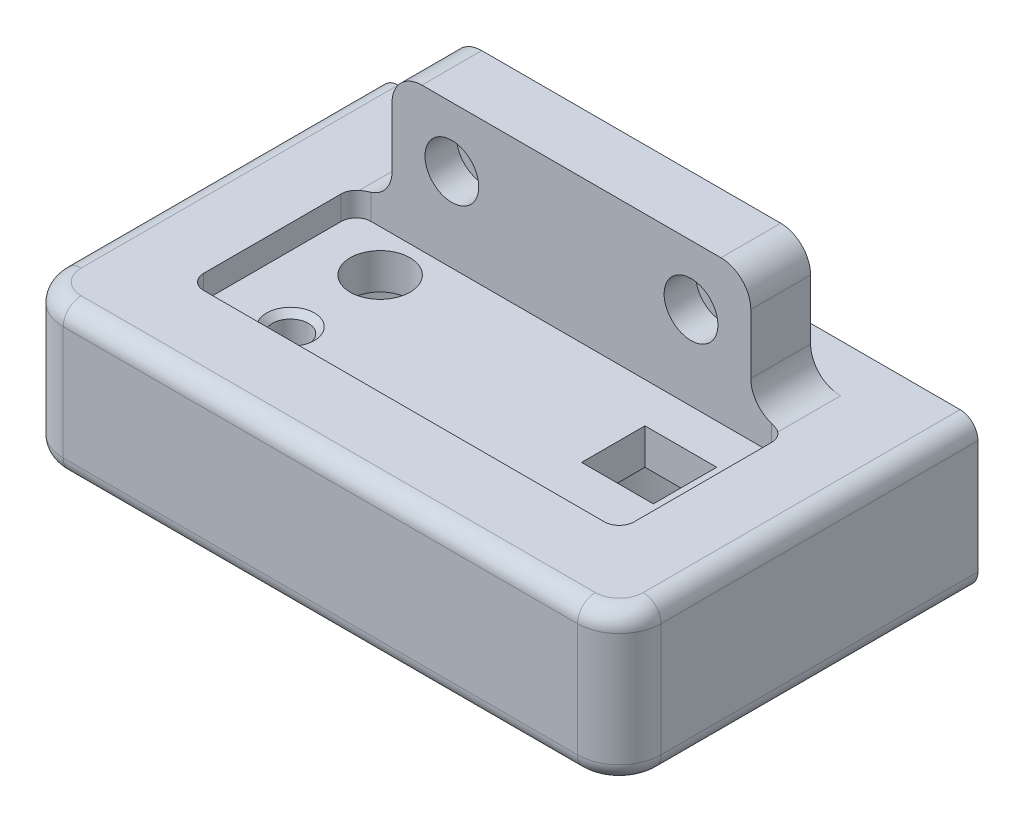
ISO-10303-21;
HEADER;
FILE_DESCRIPTION(('STEP AP214'),'2;1');
FILE_NAME('part.step','',(''),(''),'','','');
FILE_SCHEMA(('AUTOMOTIVE_DESIGN { 1 0 10303 214 1 1 1 1 }'));
ENDSEC;
DATA;
#1=APPLICATION_CONTEXT('core data for automotive mechanical design processes');
#2=APPLICATION_PROTOCOL_DEFINITION('international standard','automotive_design',2000,#1);
#3=PRODUCT_CONTEXT('',#1,'mechanical');
#4=PRODUCT('Part','Part','',(#3));
#5=PRODUCT_RELATED_PRODUCT_CATEGORY('part','',(#4));
#6=PRODUCT_DEFINITION_FORMATION('','',#4);
#7=PRODUCT_DEFINITION_CONTEXT('part definition',#1,'design');
#8=PRODUCT_DEFINITION('design','',#6,#7);
#9=PRODUCT_DEFINITION_SHAPE('','',#8);
#10=(LENGTH_UNIT() NAMED_UNIT(*) SI_UNIT(.MILLI.,.METRE.));
#11=(NAMED_UNIT(*) PLANE_ANGLE_UNIT() SI_UNIT($,.RADIAN.));
#12=(NAMED_UNIT(*) SI_UNIT($,.STERADIAN.) SOLID_ANGLE_UNIT());
#13=UNCERTAINTY_MEASURE_WITH_UNIT(LENGTH_MEASURE(1.E-05),#10,'distance_accuracy_value','');
#14=(GEOMETRIC_REPRESENTATION_CONTEXT(3) GLOBAL_UNCERTAINTY_ASSIGNED_CONTEXT((#13)) GLOBAL_UNIT_ASSIGNED_CONTEXT((#10,
#11,#12)) REPRESENTATION_CONTEXT('',''));
#15=CARTESIAN_POINT('',(0.,0.,0.));
#16=DIRECTION('',(0.,0.,1.));
#17=DIRECTION('',(1.,0.,0.));
#18=AXIS2_PLACEMENT_3D('',#15,#16,#17);
#19=CARTESIAN_POINT('',(25.,25.,25.));
#20=DIRECTION('',(0.,-1.,0.));
#21=DIRECTION('',(0.,0.,-1.));
#22=AXIS2_PLACEMENT_3D('',#19,#20,#21);
#23=CYLINDRICAL_SURFACE('',#22,5.);
#24=CARTESIAN_POINT('',(25.,15.,25.));
#25=DIRECTION('',(0.,-1.,0.));
#26=DIRECTION('',(0.,0.,1.));
#27=AXIS2_PLACEMENT_3D('',#24,#25,#26);
#28=CIRCLE('',#27,5.);
#29=CARTESIAN_POINT('',(25.,15.,30.));
#30=VERTEX_POINT('',#29);
#31=EDGE_CURVE('E325',#30,#30,#28,.T.);
#32=ORIENTED_EDGE('',*,*,#31,.T.);
#33=EDGE_LOOP('',(#32));
#34=FACE_BOUND('',#33,.T.);
#35=CARTESIAN_POINT('',(25.,21.,25.));
#36=DIRECTION('',(0.,1.,0.));
#37=DIRECTION('',(0.,0.,1.));
#38=AXIS2_PLACEMENT_3D('',#35,#36,#37);
#39=CIRCLE('',#38,5.);
#40=CARTESIAN_POINT('',(25.,21.,30.));
#41=VERTEX_POINT('',#40);
#42=EDGE_CURVE('E322',#41,#41,#39,.F.);
#43=ORIENTED_EDGE('',*,*,#42,.F.);
#44=EDGE_LOOP('',(#43));
#45=FACE_BOUND('',#44,.T.);
#46=ADVANCED_FACE('F37',(#34,#45),#23,.F.);
#47=CARTESIAN_POINT('',(25.,25.,40.));
#48=DIRECTION('',(0.,-1.,0.));
#49=DIRECTION('',(0.,0.,-1.));
#50=AXIS2_PLACEMENT_3D('',#47,#48,#49);
#51=CYLINDRICAL_SURFACE('',#50,3.00000000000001);
#52=CARTESIAN_POINT('',(25.,20.,40.));
#53=DIRECTION('',(0.,1.,0.));
#54=DIRECTION('',(0.,0.,1.));
#55=AXIS2_PLACEMENT_3D('',#52,#53,#54);
#56=CIRCLE('',#55,3.00000000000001);
#57=CARTESIAN_POINT('',(25.,20.,43.));
#58=VERTEX_POINT('',#57);
#59=EDGE_CURVE('E509',#58,#58,#56,.T.);
#60=ORIENTED_EDGE('',*,*,#59,.T.);
#61=EDGE_LOOP('',(#60));
#62=FACE_BOUND('',#61,.T.);
#63=CARTESIAN_POINT('',(25.,15.,40.));
#64=DIRECTION('',(0.,-1.,0.));
#65=DIRECTION('',(0.,0.,1.));
#66=AXIS2_PLACEMENT_3D('',#63,#64,#65);
#67=CIRCLE('',#66,3.00000000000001);
#68=CARTESIAN_POINT('',(25.,15.,43.));
#69=VERTEX_POINT('',#68);
#70=EDGE_CURVE('E330',#69,#69,#67,.T.);
#71=ORIENTED_EDGE('',*,*,#70,.T.);
#72=EDGE_LOOP('',(#71));
#73=FACE_BOUND('',#72,.T.);
#74=ADVANCED_FACE('F577',(#62,#73),#51,.F.);
#75=CARTESIAN_POINT('',(81.,25.,24.7));
#76=DIRECTION('',(1.,0.,0.));
#77=DIRECTION('',(0.,0.,-1.));
#78=AXIS2_PLACEMENT_3D('',#75,#76,#77);
#79=PLANE('',#78);
#80=DIRECTION('',(0.,0.,1.));
#81=VECTOR('',#80,1.);
#82=CARTESIAN_POINT('',(81.,21.,24.7));
#83=LINE('',#82,#81);
#84=CARTESIAN_POINT('',(81.,21.,24.7));
#85=VERTEX_POINT('',#84);
#86=CARTESIAN_POINT('',(81.,21.,35.3));
#87=VERTEX_POINT('',#86);
#88=EDGE_CURVE('E320',#85,#87,#83,.T.);
#89=ORIENTED_EDGE('',*,*,#88,.F.);
#90=DIRECTION('',(0.,-1.,0.));
#91=VECTOR('',#90,1.);
#92=CARTESIAN_POINT('',(81.,25.,24.7));
#93=LINE('',#92,#91);
#94=CARTESIAN_POINT('',(81.,15.,24.7));
#95=VERTEX_POINT('',#94);
#96=EDGE_CURVE('E340',#85,#95,#93,.T.);
#97=ORIENTED_EDGE('',*,*,#96,.T.);
#98=DIRECTION('',(0.,0.,1.));
#99=VECTOR('',#98,1.);
#100=CARTESIAN_POINT('',(81.,15.,24.7));
#101=LINE('',#100,#99);
#102=CARTESIAN_POINT('',(81.,15.,35.3));
#103=VERTEX_POINT('',#102);
#104=EDGE_CURVE('E326',#95,#103,#101,.T.);
#105=ORIENTED_EDGE('',*,*,#104,.T.);
#106=DIRECTION('',(0.,-1.,0.));
#107=VECTOR('',#106,1.);
#108=CARTESIAN_POINT('',(81.,25.,35.3));
#109=LINE('',#108,#107);
#110=EDGE_CURVE('E339',#87,#103,#109,.T.);
#111=ORIENTED_EDGE('',*,*,#110,.F.);
#112=EDGE_LOOP('',(#89,#97,#105,#111));
#113=FACE_BOUND('',#112,.T.);
#114=ADVANCED_FACE('F583',(#113),#79,.F.);
#115=CARTESIAN_POINT('',(69.,25.,24.7));
#116=DIRECTION('',(0.,0.,-1.));
#117=DIRECTION('',(-1.,0.,0.));
#118=AXIS2_PLACEMENT_3D('',#115,#116,#117);
#119=PLANE('',#118);
#120=DIRECTION('',(1.,0.,0.));
#121=VECTOR('',#120,1.);
#122=CARTESIAN_POINT('',(69.,21.,24.7));
#123=LINE('',#122,#121);
#124=CARTESIAN_POINT('',(69.,21.,24.7));
#125=VERTEX_POINT('',#124);
#126=EDGE_CURVE('E318',#125,#85,#123,.T.);
#127=ORIENTED_EDGE('',*,*,#126,.F.);
#128=DIRECTION('',(0.,-1.,0.));
#129=VECTOR('',#128,1.);
#130=CARTESIAN_POINT('',(69.,25.,24.7));
#131=LINE('',#130,#129);
#132=CARTESIAN_POINT('',(69.,15.,24.7));
#133=VERTEX_POINT('',#132);
#134=EDGE_CURVE('E343',#125,#133,#131,.T.);
#135=ORIENTED_EDGE('',*,*,#134,.T.);
#136=DIRECTION('',(1.,0.,0.));
#137=VECTOR('',#136,1.);
#138=CARTESIAN_POINT('',(69.,15.,24.7));
#139=LINE('',#138,#137);
#140=EDGE_CURVE('E336',#133,#95,#139,.T.);
#141=ORIENTED_EDGE('',*,*,#140,.T.);
#142=ORIENTED_EDGE('',*,*,#96,.F.);
#143=EDGE_LOOP('',(#127,#135,#141,#142));
#144=FACE_BOUND('',#143,.T.);
#145=ADVANCED_FACE('F789',(#144),#119,.F.);
#146=CARTESIAN_POINT('',(69.,25.,24.7));
#147=DIRECTION('',(-1.,0.,0.));
#148=DIRECTION('',(0.,0.,1.));
#149=AXIS2_PLACEMENT_3D('',#146,#147,#148);
#150=PLANE('',#149);
#151=DIRECTION('',(0.,0.,-1.));
#152=VECTOR('',#151,1.);
#153=CARTESIAN_POINT('',(69.,21.,24.7));
#154=LINE('',#153,#152);
#155=CARTESIAN_POINT('',(69.,21.,35.3));
#156=VERTEX_POINT('',#155);
#157=EDGE_CURVE('E306',#156,#125,#154,.T.);
#158=ORIENTED_EDGE('',*,*,#157,.F.);
#159=DIRECTION('',(0.,-1.,0.));
#160=VECTOR('',#159,1.);
#161=CARTESIAN_POINT('',(69.,25.,35.3));
#162=LINE('',#161,#160);
#163=CARTESIAN_POINT('',(69.,15.,35.3));
#164=VERTEX_POINT('',#163);
#165=EDGE_CURVE('E345',#156,#164,#162,.T.);
#166=ORIENTED_EDGE('',*,*,#165,.T.);
#167=DIRECTION('',(0.,0.,-1.));
#168=VECTOR('',#167,1.);
#169=CARTESIAN_POINT('',(69.,15.,24.7));
#170=LINE('',#169,#168);
#171=EDGE_CURVE('E333',#164,#133,#170,.T.);
#172=ORIENTED_EDGE('',*,*,#171,.T.);
#173=ORIENTED_EDGE('',*,*,#134,.F.);
#174=EDGE_LOOP('',(#158,#166,#172,#173));
#175=FACE_BOUND('',#174,.T.);
#176=ADVANCED_FACE('F792',(#175),#150,.F.);
#177=CARTESIAN_POINT('',(69.,25.,35.3));
#178=DIRECTION('',(0.,0.,1.));
#179=DIRECTION('',(1.,0.,0.));
#180=AXIS2_PLACEMENT_3D('',#177,#178,#179);
#181=PLANE('',#180);
#182=DIRECTION('',(-1.,0.,0.));
#183=VECTOR('',#182,1.);
#184=CARTESIAN_POINT('',(69.,21.,35.3));
#185=LINE('',#184,#183);
#186=EDGE_CURVE('E479',#87,#156,#185,.T.);
#187=ORIENTED_EDGE('',*,*,#186,.F.);
#188=ORIENTED_EDGE('',*,*,#110,.T.);
#189=DIRECTION('',(-1.,0.,0.));
#190=VECTOR('',#189,1.);
#191=CARTESIAN_POINT('',(69.,15.,35.3));
#192=LINE('',#191,#190);
#193=EDGE_CURVE('E329',#103,#164,#192,.T.);
#194=ORIENTED_EDGE('',*,*,#193,.T.);
#195=ORIENTED_EDGE('',*,*,#165,.F.);
#196=EDGE_LOOP('',(#187,#188,#194,#195));
#197=FACE_BOUND('',#196,.T.);
#198=ADVANCED_FACE('F640',(#197),#181,.F.);
#199=CARTESIAN_POINT('',(30.,35.,18.));
#200=DIRECTION('',(0.,0.,-1.));
#201=DIRECTION('',(-1.,0.,0.));
#202=AXIS2_PLACEMENT_3D('',#199,#200,#201);
#203=CYLINDRICAL_SURFACE('',#202,3.);
#204=CARTESIAN_POINT('',(30.,35.,8.));
#205=DIRECTION('',(0.,0.,-1.));
#206=DIRECTION('',(-1.,0.,0.));
#207=AXIS2_PLACEMENT_3D('',#204,#205,#206);
#208=CIRCLE('',#207,3.);
#209=CARTESIAN_POINT('',(27.,35.,8.));
#210=VERTEX_POINT('',#209);
#211=EDGE_CURVE('E381',#210,#210,#208,.T.);
#212=ORIENTED_EDGE('',*,*,#211,.T.);
#213=EDGE_LOOP('',(#212));
#214=FACE_BOUND('',#213,.T.);
#215=CARTESIAN_POINT('',(30.,35.,12.7));
#216=DIRECTION('',(0.,0.,1.));
#217=DIRECTION('',(1.,0.,0.));
#218=AXIS2_PLACEMENT_3D('',#215,#216,#217);
#219=CIRCLE('',#218,3.);
#220=CARTESIAN_POINT('',(33.,35.,12.7));
#221=VERTEX_POINT('',#220);
#222=EDGE_CURVE('E377',#221,#221,#219,.F.);
#223=ORIENTED_EDGE('',*,*,#222,.F.);
#224=EDGE_LOOP('',(#223));
#225=FACE_BOUND('',#224,.T.);
#226=ADVANCED_FACE('F636',(#214,#225),#203,.F.);
#227=CARTESIAN_POINT('',(70.,35.,18.));
#228=DIRECTION('',(0.,0.,-1.));
#229=DIRECTION('',(-1.,0.,0.));
#230=AXIS2_PLACEMENT_3D('',#227,#228,#229);
#231=CYLINDRICAL_SURFACE('',#230,3.00000000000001);
#232=CARTESIAN_POINT('',(70.,35.,8.));
#233=DIRECTION('',(0.,0.,-1.));
#234=DIRECTION('',(-1.,0.,0.));
#235=AXIS2_PLACEMENT_3D('',#232,#233,#234);
#236=CIRCLE('',#235,3.00000000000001);
#237=CARTESIAN_POINT('',(67.,35.,8.));
#238=VERTEX_POINT('',#237);
#239=EDGE_CURVE('E386',#238,#238,#236,.T.);
#240=ORIENTED_EDGE('',*,*,#239,.T.);
#241=EDGE_LOOP('',(#240));
#242=FACE_BOUND('',#241,.T.);
#243=CARTESIAN_POINT('',(70.,35.,12.7));
#244=DIRECTION('',(0.,0.,1.));
#245=DIRECTION('',(1.,0.,0.));
#246=AXIS2_PLACEMENT_3D('',#243,#244,#245);
#247=CIRCLE('',#246,3.00000000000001);
#248=CARTESIAN_POINT('',(73.,35.,12.7));
#249=VERTEX_POINT('',#248);
#250=EDGE_CURVE('E355',#249,#249,#247,.F.);
#251=ORIENTED_EDGE('',*,*,#250,.F.);
#252=EDGE_LOOP('',(#251));
#253=FACE_BOUND('',#252,.T.);
#254=ADVANCED_FACE('F632',(#242,#253),#231,.F.);
#255=CARTESIAN_POINT('',(100.,0.,60.));
#256=DIRECTION('',(-1.,0.,0.));
#257=DIRECTION('',(0.,0.,1.));
#258=AXIS2_PLACEMENT_3D('',#255,#256,#257);
#259=PLANE('',#258);
#260=DIRECTION('',(0.,1.,0.));
#261=VECTOR('',#260,1.);
#262=CARTESIAN_POINT('',(100.,0.,0.));
#263=LINE('',#262,#261);
#264=CARTESIAN_POINT('',(100.,3.,0.));
#265=VERTEX_POINT('',#264);
#266=CARTESIAN_POINT('',(100.,22.,0.));
#267=VERTEX_POINT('',#266);
#268=EDGE_CURVE('E417',#265,#267,#263,.T.);
#269=ORIENTED_EDGE('',*,*,#268,.T.);
#270=DIRECTION('',(0.,0.,-1.));
#271=VECTOR('',#270,1.);
#272=CARTESIAN_POINT('',(100.,22.,60.));
#273=LINE('',#272,#271);
#274=CARTESIAN_POINT('',(100.,22.,53.));
#275=VERTEX_POINT('',#274);
#276=EDGE_CURVE('E450',#267,#275,#273,.F.);
#277=ORIENTED_EDGE('',*,*,#276,.T.);
#278=DIRECTION('',(0.,-1.,0.));
#279=VECTOR('',#278,1.);
#280=CARTESIAN_POINT('',(100.,45.,53.));
#281=LINE('',#280,#279);
#282=CARTESIAN_POINT('',(100.,3.00000000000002,53.));
#283=VERTEX_POINT('',#282);
#284=EDGE_CURVE('E382',#275,#283,#281,.T.);
#285=ORIENTED_EDGE('',*,*,#284,.T.);
#286=DIRECTION('',(0.,0.,-1.));
#287=VECTOR('',#286,1.);
#288=CARTESIAN_POINT('',(100.,3.,60.));
#289=LINE('',#288,#287);
#290=EDGE_CURVE('E448',#283,#265,#289,.T.);
#291=ORIENTED_EDGE('',*,*,#290,.T.);
#292=EDGE_LOOP('',(#269,#277,#285,#291));
#293=FACE_BOUND('',#292,.T.);
#294=ADVANCED_FACE('F635',(#293),#259,.F.);
#295=CARTESIAN_POINT('',(0.,0.,60.));
#296=DIRECTION('',(0.,0.,-1.));
#297=DIRECTION('',(-1.,0.,0.));
#298=AXIS2_PLACEMENT_3D('',#295,#296,#297);
#299=PLANE('',#298);
#300=DIRECTION('',(0.,-1.,0.));
#301=VECTOR('',#300,1.);
#302=CARTESIAN_POINT('',(93.,45.,60.));
#303=LINE('',#302,#301);
#304=CARTESIAN_POINT('',(93.,3.00000000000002,60.));
#305=VERTEX_POINT('',#304);
#306=CARTESIAN_POINT('',(93.,22.,60.));
#307=VERTEX_POINT('',#306);
#308=EDGE_CURVE('E423',#305,#307,#303,.F.);
#309=ORIENTED_EDGE('',*,*,#308,.T.);
#310=DIRECTION('',(-1.,0.,0.));
#311=VECTOR('',#310,1.);
#312=CARTESIAN_POINT('',(0.,22.,60.));
#313=LINE('',#312,#311);
#314=CARTESIAN_POINT('',(7.,22.,60.));
#315=VERTEX_POINT('',#314);
#316=EDGE_CURVE('E458',#307,#315,#313,.T.);
#317=ORIENTED_EDGE('',*,*,#316,.T.);
#318=DIRECTION('',(0.,-1.,0.));
#319=VECTOR('',#318,1.);
#320=CARTESIAN_POINT('',(7.,45.,60.));
#321=LINE('',#320,#319);
#322=CARTESIAN_POINT('',(7.,3.00000000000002,60.));
#323=VERTEX_POINT('',#322);
#324=EDGE_CURVE('E426',#323,#315,#321,.F.);
#325=ORIENTED_EDGE('',*,*,#324,.F.);
#326=DIRECTION('',(1.,0.,0.));
#327=VECTOR('',#326,1.);
#328=CARTESIAN_POINT('',(0.,3.,60.));
#329=LINE('',#328,#327);
#330=EDGE_CURVE('E456',#323,#305,#329,.T.);
#331=ORIENTED_EDGE('',*,*,#330,.T.);
#332=EDGE_LOOP('',(#309,#317,#325,#331));
#333=FACE_BOUND('',#332,.T.);
#334=ADVANCED_FACE('F662',(#333),#299,.F.);
#335=CARTESIAN_POINT('',(0.,25.,60.));
#336=DIRECTION('',(0.,-1.,0.));
#337=DIRECTION('',(0.,0.,-1.));
#338=AXIS2_PLACEMENT_3D('',#335,#336,#337);
#339=PLANE('',#338);
#340=CARTESIAN_POINT('',(93.,25.,53.));
#341=DIRECTION('',(0.,-1.,0.));
#342=DIRECTION('',(0.,0.,-1.));
#343=AXIS2_PLACEMENT_3D('',#340,#341,#342);
#344=CIRCLE('',#343,4.00000000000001);
#345=CARTESIAN_POINT('',(93.,25.,57.));
#346=VERTEX_POINT('',#345);
#347=CARTESIAN_POINT('',(97.,25.,53.));
#348=VERTEX_POINT('',#347);
#349=EDGE_CURVE('E435',#346,#348,#344,.F.);
#350=ORIENTED_EDGE('',*,*,#349,.T.);
#351=DIRECTION('',(0.,0.,-1.));
#352=VECTOR('',#351,1.);
#353=CARTESIAN_POINT('',(97.,25.,60.));
#354=LINE('',#353,#352);
#355=CARTESIAN_POINT('',(97.,25.,0.));
#356=VERTEX_POINT('',#355);
#357=EDGE_CURVE('E437',#348,#356,#354,.T.);
#358=ORIENTED_EDGE('',*,*,#357,.T.);
#359=DIRECTION('',(-1.,0.,0.));
#360=VECTOR('',#359,1.);
#361=CARTESIAN_POINT('',(0.,25.,0.));
#362=LINE('',#361,#360);
#363=CARTESIAN_POINT('',(3.,25.,0.));
#364=VERTEX_POINT('',#363);
#365=EDGE_CURVE('E420',#356,#364,#362,.T.);
#366=ORIENTED_EDGE('',*,*,#365,.T.);
#367=DIRECTION('',(0.,0.,-1.));
#368=VECTOR('',#367,1.);
#369=CARTESIAN_POINT('',(3.,25.,60.));
#370=LINE('',#369,#368);
#371=CARTESIAN_POINT('',(3.,25.,53.));
#372=VERTEX_POINT('',#371);
#373=EDGE_CURVE('E429',#364,#372,#370,.F.);
#374=ORIENTED_EDGE('',*,*,#373,.T.);
#375=CARTESIAN_POINT('',(7.,25.,53.));
#376=DIRECTION('',(0.,-1.,0.));
#377=DIRECTION('',(0.,0.,-1.));
#378=AXIS2_PLACEMENT_3D('',#375,#376,#377);
#379=CIRCLE('',#378,4.);
#380=CARTESIAN_POINT('',(7.,25.,57.));
#381=VERTEX_POINT('',#380);
#382=EDGE_CURVE('E431',#372,#381,#379,.F.);
#383=ORIENTED_EDGE('',*,*,#382,.T.);
#384=DIRECTION('',(-1.,0.,0.));
#385=VECTOR('',#384,1.);
#386=CARTESIAN_POINT('',(0.,25.,57.));
#387=LINE('',#386,#385);
#388=EDGE_CURVE('E433',#381,#346,#387,.F.);
#389=ORIENTED_EDGE('',*,*,#388,.T.);
#390=EDGE_LOOP('',(#350,#358,#366,#374,#383,#389));
#391=FACE_BOUND('',#390,.T.);
#392=CARTESIAN_POINT('',(16.5,25.,20.5));
#393=DIRECTION('',(0.,1.,0.));
#394=DIRECTION('',(0.,0.,-1.));
#395=AXIS2_PLACEMENT_3D('',#392,#393,#394);
#396=CIRCLE('',#395,2.5);
#397=CARTESIAN_POINT('',(15.,25.,18.5));
#398=VERTEX_POINT('',#397);
#399=CARTESIAN_POINT('',(14.,25.,20.5));
#400=VERTEX_POINT('',#399);
#401=EDGE_CURVE('E297',#398,#400,#396,.T.);
#402=ORIENTED_EDGE('',*,*,#401,.F.);
#403=DIRECTION('',(0.,0.,1.));
#404=VECTOR('',#403,1.);
#405=CARTESIAN_POINT('',(15.,25.,8.));
#406=LINE('',#405,#404);
#407=CARTESIAN_POINT('',(15.,25.,8.));
#408=VERTEX_POINT('',#407);
#409=EDGE_CURVE('E519',#398,#408,#406,.F.);
#410=ORIENTED_EDGE('',*,*,#409,.T.);
#411=DIRECTION('',(-1.,0.,0.));
#412=VECTOR('',#411,1.);
#413=CARTESIAN_POINT('',(20.,25.,8.));
#414=LINE('',#413,#412);
#415=CARTESIAN_POINT('',(85.,25.,8.));
#416=VERTEX_POINT('',#415);
#417=EDGE_CURVE('E389',#416,#408,#414,.T.);
#418=ORIENTED_EDGE('',*,*,#417,.F.);
#419=DIRECTION('',(0.,0.,-1.));
#420=VECTOR('',#419,1.);
#421=CARTESIAN_POINT('',(85.,25.,18.));
#422=LINE('',#421,#420);
#423=CARTESIAN_POINT('',(85.,25.,18.5));
#424=VERTEX_POINT('',#423);
#425=EDGE_CURVE('E517',#416,#424,#422,.F.);
#426=ORIENTED_EDGE('',*,*,#425,.T.);
#427=CARTESIAN_POINT('',(83.5,25.,20.5));
#428=DIRECTION('',(0.,1.,0.));
#429=DIRECTION('',(0.,0.,-1.));
#430=AXIS2_PLACEMENT_3D('',#427,#428,#429);
#431=CIRCLE('',#430,2.5);
#432=CARTESIAN_POINT('',(86.,25.,20.5));
#433=VERTEX_POINT('',#432);
#434=EDGE_CURVE('E294',#433,#424,#431,.T.);
#435=ORIENTED_EDGE('',*,*,#434,.F.);
#436=DIRECTION('',(0.,0.,-1.));
#437=VECTOR('',#436,1.);
#438=CARTESIAN_POINT('',(86.,25.,43.5));
#439=LINE('',#438,#437);
#440=CARTESIAN_POINT('',(86.,25.,43.5));
#441=VERTEX_POINT('',#440);
#442=EDGE_CURVE('E292',#441,#433,#439,.T.);
#443=ORIENTED_EDGE('',*,*,#442,.F.);
#444=CARTESIAN_POINT('',(83.5,25.,43.5));
#445=DIRECTION('',(0.,1.,0.));
#446=DIRECTION('',(0.,0.,1.));
#447=AXIS2_PLACEMENT_3D('',#444,#445,#446);
#448=CIRCLE('',#447,2.5);
#449=CARTESIAN_POINT('',(83.5,25.,46.));
#450=VERTEX_POINT('',#449);
#451=EDGE_CURVE('E253',#450,#441,#448,.T.);
#452=ORIENTED_EDGE('',*,*,#451,.F.);
#453=DIRECTION('',(1.,0.,0.));
#454=VECTOR('',#453,1.);
#455=CARTESIAN_POINT('',(16.5,25.,46.));
#456=LINE('',#455,#454);
#457=CARTESIAN_POINT('',(16.5,25.,46.));
#458=VERTEX_POINT('',#457);
#459=EDGE_CURVE('E272',#458,#450,#456,.T.);
#460=ORIENTED_EDGE('',*,*,#459,.F.);
#461=CARTESIAN_POINT('',(16.5,25.,43.5));
#462=DIRECTION('',(0.,1.,0.));
#463=DIRECTION('',(0.,0.,-1.));
#464=AXIS2_PLACEMENT_3D('',#461,#462,#463);
#465=CIRCLE('',#464,2.5);
#466=CARTESIAN_POINT('',(14.,25.,43.5));
#467=VERTEX_POINT('',#466);
#468=EDGE_CURVE('E275',#467,#458,#465,.T.);
#469=ORIENTED_EDGE('',*,*,#468,.F.);
#470=DIRECTION('',(0.,0.,1.));
#471=VECTOR('',#470,1.);
#472=CARTESIAN_POINT('',(14.,25.,43.5));
#473=LINE('',#472,#471);
#474=EDGE_CURVE('E299',#400,#467,#473,.T.);
#475=ORIENTED_EDGE('',*,*,#474,.F.);
#476=EDGE_LOOP('',(#402,#410,#418,#426,#435,#443,#452,#460,#469,#475));
#477=FACE_BOUND('',#476,.T.);
#478=ADVANCED_FACE('F665',(#391,#477),#339,.F.);
#479=CARTESIAN_POINT('',(0.,0.,60.));
#480=DIRECTION('',(1.,0.,0.));
#481=DIRECTION('',(0.,0.,-1.));
#482=AXIS2_PLACEMENT_3D('',#479,#480,#481);
#483=PLANE('',#482);
#484=DIRECTION('',(0.,-1.,0.));
#485=VECTOR('',#484,1.);
#486=CARTESIAN_POINT('',(0.,45.,53.));
#487=LINE('',#486,#485);
#488=CARTESIAN_POINT('',(0.,22.,53.));
#489=VERTEX_POINT('',#488);
#490=CARTESIAN_POINT('',(0.,3.00000000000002,53.));
#491=VERTEX_POINT('',#490);
#492=EDGE_CURVE('E378',#489,#491,#487,.T.);
#493=ORIENTED_EDGE('',*,*,#492,.F.);
#494=DIRECTION('',(0.,0.,-1.));
#495=VECTOR('',#494,1.);
#496=CARTESIAN_POINT('',(0.,22.,60.));
#497=LINE('',#496,#495);
#498=CARTESIAN_POINT('',(0.,22.,0.));
#499=VERTEX_POINT('',#498);
#500=EDGE_CURVE('E467',#489,#499,#497,.T.);
#501=ORIENTED_EDGE('',*,*,#500,.T.);
#502=DIRECTION('',(0.,-1.,0.));
#503=VECTOR('',#502,1.);
#504=CARTESIAN_POINT('',(0.,0.,0.));
#505=LINE('',#504,#503);
#506=CARTESIAN_POINT('',(0.,3.,0.));
#507=VERTEX_POINT('',#506);
#508=EDGE_CURVE('E411',#499,#507,#505,.T.);
#509=ORIENTED_EDGE('',*,*,#508,.T.);
#510=DIRECTION('',(0.,0.,-1.));
#511=VECTOR('',#510,1.);
#512=CARTESIAN_POINT('',(0.,3.,60.));
#513=LINE('',#512,#511);
#514=EDGE_CURVE('E465',#507,#491,#513,.F.);
#515=ORIENTED_EDGE('',*,*,#514,.T.);
#516=EDGE_LOOP('',(#493,#501,#509,#515));
#517=FACE_BOUND('',#516,.T.);
#518=ADVANCED_FACE('F673',(#517),#483,.F.);
#519=CARTESIAN_POINT('',(0.,0.,60.));
#520=DIRECTION('',(0.,1.,0.));
#521=DIRECTION('',(0.,0.,1.));
#522=AXIS2_PLACEMENT_3D('',#519,#520,#521);
#523=PLANE('',#522);
#524=CARTESIAN_POINT('',(25.,0.,30.));
#525=DIRECTION('',(0.,-1.,0.));
#526=DIRECTION('',(0.,0.,-1.));
#527=AXIS2_PLACEMENT_3D('',#524,#525,#526);
#528=CIRCLE('',#527,20.);
#529=CARTESIAN_POINT('',(25.,0.,9.99999999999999));
#530=VERTEX_POINT('',#529);
#531=EDGE_CURVE('E368',#530,#530,#528,.T.);
#532=ORIENTED_EDGE('',*,*,#531,.F.);
#533=EDGE_LOOP('',(#532));
#534=FACE_BOUND('',#533,.T.);
#535=CARTESIAN_POINT('',(75.,0.,30.));
#536=DIRECTION('',(0.,-1.,0.));
#537=DIRECTION('',(0.,0.,-1.));
#538=AXIS2_PLACEMENT_3D('',#535,#536,#537);
#539=CIRCLE('',#538,20.);
#540=CARTESIAN_POINT('',(75.,0.,9.99999999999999));
#541=VERTEX_POINT('',#540);
#542=EDGE_CURVE('E374',#541,#541,#539,.T.);
#543=ORIENTED_EDGE('',*,*,#542,.F.);
#544=EDGE_LOOP('',(#543));
#545=FACE_BOUND('',#544,.T.);
#546=CARTESIAN_POINT('',(7.,0.,53.));
#547=DIRECTION('',(0.,1.,0.));
#548=DIRECTION('',(0.,0.,1.));
#549=AXIS2_PLACEMENT_3D('',#546,#547,#548);
#550=CIRCLE('',#549,4.);
#551=CARTESIAN_POINT('',(7.,0.,57.));
#552=VERTEX_POINT('',#551);
#553=CARTESIAN_POINT('',(3.,0.,53.));
#554=VERTEX_POINT('',#553);
#555=EDGE_CURVE('E475',#552,#554,#550,.F.);
#556=ORIENTED_EDGE('',*,*,#555,.T.);
#557=DIRECTION('',(0.,0.,-1.));
#558=VECTOR('',#557,1.);
#559=CARTESIAN_POINT('',(3.,0.,60.));
#560=LINE('',#559,#558);
#561=CARTESIAN_POINT('',(3.,0.,0.));
#562=VERTEX_POINT('',#561);
#563=EDGE_CURVE('E477',#554,#562,#560,.T.);
#564=ORIENTED_EDGE('',*,*,#563,.T.);
#565=DIRECTION('',(1.,0.,0.));
#566=VECTOR('',#565,1.);
#567=CARTESIAN_POINT('',(0.,0.,0.));
#568=LINE('',#567,#566);
#569=CARTESIAN_POINT('',(97.,0.,0.));
#570=VERTEX_POINT('',#569);
#571=EDGE_CURVE('E414',#562,#570,#568,.T.);
#572=ORIENTED_EDGE('',*,*,#571,.T.);
#573=DIRECTION('',(0.,0.,-1.));
#574=VECTOR('',#573,1.);
#575=CARTESIAN_POINT('',(97.,0.,60.));
#576=LINE('',#575,#574);
#577=CARTESIAN_POINT('',(97.,0.,53.));
#578=VERTEX_POINT('',#577);
#579=EDGE_CURVE('E469',#570,#578,#576,.F.);
#580=ORIENTED_EDGE('',*,*,#579,.T.);
#581=CARTESIAN_POINT('',(93.,0.,53.));
#582=DIRECTION('',(0.,1.,0.));
#583=DIRECTION('',(0.,0.,1.));
#584=AXIS2_PLACEMENT_3D('',#581,#582,#583);
#585=CIRCLE('',#584,4.00000000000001);
#586=CARTESIAN_POINT('',(93.,0.,57.));
#587=VERTEX_POINT('',#586);
#588=EDGE_CURVE('E471',#578,#587,#585,.F.);
#589=ORIENTED_EDGE('',*,*,#588,.T.);
#590=DIRECTION('',(1.,0.,0.));
#591=VECTOR('',#590,1.);
#592=CARTESIAN_POINT('',(0.,0.,57.));
#593=LINE('',#592,#591);
#594=EDGE_CURVE('E473',#587,#552,#593,.F.);
#595=ORIENTED_EDGE('',*,*,#594,.T.);
#596=EDGE_LOOP('',(#556,#564,#572,#580,#589,#595));
#597=FACE_BOUND('',#596,.T.);
#598=ADVANCED_FACE('F669',(#534,#545,#597),#523,.F.);
#599=CARTESIAN_POINT('',(0.,0.,0.));
#600=DIRECTION('',(0.,0.,-1.));
#601=DIRECTION('',(-1.,0.,0.));
#602=AXIS2_PLACEMENT_3D('',#599,#600,#601);
#603=PLANE('',#602);
#604=ORIENTED_EDGE('',*,*,#365,.F.);
#605=CARTESIAN_POINT('',(97.,22.,0.));
#606=DIRECTION('',(0.,0.,-1.));
#607=DIRECTION('',(-1.,0.,0.));
#608=AXIS2_PLACEMENT_3D('',#605,#606,#607);
#609=CIRCLE('',#608,3.);
#610=EDGE_CURVE('E446',#356,#267,#609,.T.);
#611=ORIENTED_EDGE('',*,*,#610,.T.);
#612=ORIENTED_EDGE('',*,*,#268,.F.);
#613=CARTESIAN_POINT('',(97.,3.,0.));
#614=DIRECTION('',(0.,0.,-1.));
#615=DIRECTION('',(-1.,0.,0.));
#616=AXIS2_PLACEMENT_3D('',#613,#614,#615);
#617=CIRCLE('',#616,3.);
#618=EDGE_CURVE('E440',#265,#570,#617,.T.);
#619=ORIENTED_EDGE('',*,*,#618,.T.);
#620=ORIENTED_EDGE('',*,*,#571,.F.);
#621=CARTESIAN_POINT('',(3.,3.,0.));
#622=DIRECTION('',(0.,0.,-1.));
#623=DIRECTION('',(-1.,0.,0.));
#624=AXIS2_PLACEMENT_3D('',#621,#622,#623);
#625=CIRCLE('',#624,3.);
#626=EDGE_CURVE('E442',#562,#507,#625,.T.);
#627=ORIENTED_EDGE('',*,*,#626,.T.);
#628=ORIENTED_EDGE('',*,*,#508,.F.);
#629=CARTESIAN_POINT('',(3.,22.,0.));
#630=DIRECTION('',(0.,0.,-1.));
#631=DIRECTION('',(-1.,0.,0.));
#632=AXIS2_PLACEMENT_3D('',#629,#630,#631);
#633=CIRCLE('',#632,3.);
#634=EDGE_CURVE('E444',#499,#364,#633,.T.);
#635=ORIENTED_EDGE('',*,*,#634,.T.);
#636=EDGE_LOOP('',(#604,#611,#612,#619,#620,#627,#628,#635));
#637=FACE_BOUND('',#636,.T.);
#638=ADVANCED_FACE('F660',(#637),#603,.T.);
#639=CARTESIAN_POINT('',(20.,45.,8.));
#640=DIRECTION('',(1.,0.,0.));
#641=DIRECTION('',(0.,0.,-1.));
#642=AXIS2_PLACEMENT_3D('',#639,#640,#641);
#643=PLANE('',#642);
#644=DIRECTION('',(0.,-1.,0.));
#645=VECTOR('',#644,1.);
#646=CARTESIAN_POINT('',(20.,45.,8.));
#647=LINE('',#646,#645);
#648=CARTESIAN_POINT('',(20.,40.,8.));
#649=VERTEX_POINT('',#648);
#650=CARTESIAN_POINT('',(20.,30.,8.));
#651=VERTEX_POINT('',#650);
#652=EDGE_CURVE('E398',#649,#651,#647,.T.);
#653=ORIENTED_EDGE('',*,*,#652,.T.);
#654=DIRECTION('',(0.,0.,1.));
#655=VECTOR('',#654,1.);
#656=CARTESIAN_POINT('',(20.,30.,18.));
#657=LINE('',#656,#655);
#658=CARTESIAN_POINT('',(20.,30.,18.));
#659=VERTEX_POINT('',#658);
#660=EDGE_CURVE('E514',#651,#659,#657,.T.);
#661=ORIENTED_EDGE('',*,*,#660,.T.);
#662=DIRECTION('',(0.,-1.,0.));
#663=VECTOR('',#662,1.);
#664=CARTESIAN_POINT('',(20.,45.,18.));
#665=LINE('',#664,#663);
#666=CARTESIAN_POINT('',(20.,40.,18.));
#667=VERTEX_POINT('',#666);
#668=EDGE_CURVE('E408',#667,#659,#665,.T.);
#669=ORIENTED_EDGE('',*,*,#668,.F.);
#670=DIRECTION('',(0.,0.,1.));
#671=VECTOR('',#670,1.);
#672=CARTESIAN_POINT('',(20.,40.,8.));
#673=LINE('',#672,#671);
#674=EDGE_CURVE('E512',#667,#649,#673,.F.);
#675=ORIENTED_EDGE('',*,*,#674,.T.);
#676=EDGE_LOOP('',(#653,#661,#669,#675));
#677=FACE_BOUND('',#676,.T.);
#678=ADVANCED_FACE('F656',(#677),#643,.F.);
#679=CARTESIAN_POINT('',(20.,45.,18.));
#680=DIRECTION('',(0.,0.,-1.));
#681=DIRECTION('',(-1.,0.,0.));
#682=AXIS2_PLACEMENT_3D('',#679,#680,#681);
#683=PLANE('',#682);
#684=CARTESIAN_POINT('',(30.,35.,18.));
#685=DIRECTION('',(0.,0.,1.));
#686=DIRECTION('',(1.,0.,0.));
#687=AXIS2_PLACEMENT_3D('',#684,#685,#686);
#688=CIRCLE('',#687,4.5);
#689=CARTESIAN_POINT('',(34.5,35.,18.));
#690=VERTEX_POINT('',#689);
#691=EDGE_CURVE('E356',#690,#690,#688,.T.);
#692=ORIENTED_EDGE('',*,*,#691,.F.);
#693=EDGE_LOOP('',(#692));
#694=FACE_BOUND('',#693,.T.);
#695=CARTESIAN_POINT('',(70.,35.,18.));
#696=DIRECTION('',(0.,0.,1.));
#697=DIRECTION('',(1.,0.,0.));
#698=AXIS2_PLACEMENT_3D('',#695,#696,#697);
#699=CIRCLE('',#698,4.50000000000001);
#700=CARTESIAN_POINT('',(74.5,35.,18.));
#701=VERTEX_POINT('',#700);
#702=EDGE_CURVE('E342',#701,#701,#699,.T.);
#703=ORIENTED_EDGE('',*,*,#702,.F.);
#704=EDGE_LOOP('',(#703));
#705=FACE_BOUND('',#704,.T.);
#706=DIRECTION('',(1.,0.,0.));
#707=VECTOR('',#706,1.);
#708=CARTESIAN_POINT('',(20.,45.,18.));
#709=LINE('',#708,#707);
#710=CARTESIAN_POINT('',(25.,45.,18.));
#711=VERTEX_POINT('',#710);
#712=CARTESIAN_POINT('',(75.,45.,18.));
#713=VERTEX_POINT('',#712);
#714=EDGE_CURVE('E392',#711,#713,#709,.T.);
#715=ORIENTED_EDGE('',*,*,#714,.F.);
#716=CARTESIAN_POINT('',(25.,40.,18.));
#717=DIRECTION('',(0.,0.,-1.));
#718=DIRECTION('',(-1.,0.,0.));
#719=AXIS2_PLACEMENT_3D('',#716,#717,#718);
#720=CIRCLE('',#719,5.);
#721=EDGE_CURVE('E530',#711,#667,#720,.F.);
#722=ORIENTED_EDGE('',*,*,#721,.T.);
#723=ORIENTED_EDGE('',*,*,#668,.T.);
#724=CARTESIAN_POINT('',(15.,30.,18.));
#725=DIRECTION('',(0.,0.,-1.));
#726=DIRECTION('',(-1.,0.,0.));
#727=AXIS2_PLACEMENT_3D('',#724,#725,#726);
#728=CIRCLE('',#727,5.);
#729=CARTESIAN_POINT('',(16.5,25.2303039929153,18.));
#730=VERTEX_POINT('',#729);
#731=EDGE_CURVE('E541',#659,#730,#728,.T.);
#732=ORIENTED_EDGE('',*,*,#731,.T.);
#733=DIRECTION('',(0.,1.,0.));
#734=VECTOR('',#733,1.);
#735=CARTESIAN_POINT('',(16.5,21.,18.));
#736=LINE('',#735,#734);
#737=CARTESIAN_POINT('',(16.5,21.,18.));
#738=VERTEX_POINT('',#737);
#739=EDGE_CURVE('E60',#738,#730,#736,.T.);
#740=ORIENTED_EDGE('',*,*,#739,.F.);
#741=DIRECTION('',(-1.,0.,0.));
#742=VECTOR('',#741,1.);
#743=CARTESIAN_POINT('',(16.5,21.,18.));
#744=LINE('',#743,#742);
#745=CARTESIAN_POINT('',(83.5,21.,18.));
#746=VERTEX_POINT('',#745);
#747=EDGE_CURVE('E279',#746,#738,#744,.T.);
#748=ORIENTED_EDGE('',*,*,#747,.F.);
#749=DIRECTION('',(0.,1.,0.));
#750=VECTOR('',#749,1.);
#751=CARTESIAN_POINT('',(83.5,21.,18.));
#752=LINE('',#751,#750);
#753=CARTESIAN_POINT('',(83.5,25.2303039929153,18.));
#754=VERTEX_POINT('',#753);
#755=EDGE_CURVE('E52',#746,#754,#752,.T.);
#756=ORIENTED_EDGE('',*,*,#755,.T.);
#757=CARTESIAN_POINT('',(85.,30.,18.));
#758=DIRECTION('',(0.,0.,-1.));
#759=DIRECTION('',(-1.,0.,0.));
#760=AXIS2_PLACEMENT_3D('',#757,#758,#759);
#761=CIRCLE('',#760,5.);
#762=CARTESIAN_POINT('',(80.,30.,18.));
#763=VERTEX_POINT('',#762);
#764=EDGE_CURVE('E11',#754,#763,#761,.T.);
#765=ORIENTED_EDGE('',*,*,#764,.T.);
#766=DIRECTION('',(0.,-1.,0.));
#767=VECTOR('',#766,1.);
#768=CARTESIAN_POINT('',(80.,45.,18.));
#769=LINE('',#768,#767);
#770=CARTESIAN_POINT('',(80.,40.,18.));
#771=VERTEX_POINT('',#770);
#772=EDGE_CURVE('E405',#771,#763,#769,.T.);
#773=ORIENTED_EDGE('',*,*,#772,.F.);
#774=CARTESIAN_POINT('',(75.,40.,18.));
#775=DIRECTION('',(0.,0.,-1.));
#776=DIRECTION('',(-1.,0.,0.));
#777=AXIS2_PLACEMENT_3D('',#774,#775,#776);
#778=CIRCLE('',#777,5.);
#779=EDGE_CURVE('E528',#771,#713,#778,.F.);
#780=ORIENTED_EDGE('',*,*,#779,.T.);
#781=EDGE_LOOP('',(#715,#722,#723,#732,#740,#748,#756,#765,#773,#780));
#782=FACE_BOUND('',#781,.T.);
#783=ADVANCED_FACE('F652',(#694,#705,#782),#683,.F.);
#784=CARTESIAN_POINT('',(80.,45.,8.));
#785=DIRECTION('',(-1.,0.,0.));
#786=DIRECTION('',(0.,0.,1.));
#787=AXIS2_PLACEMENT_3D('',#784,#785,#786);
#788=PLANE('',#787);
#789=DIRECTION('',(0.,-1.,0.));
#790=VECTOR('',#789,1.);
#791=CARTESIAN_POINT('',(80.,45.,8.));
#792=LINE('',#791,#790);
#793=CARTESIAN_POINT('',(80.,40.,8.));
#794=VERTEX_POINT('',#793);
#795=CARTESIAN_POINT('',(80.,30.,8.));
#796=VERTEX_POINT('',#795);
#797=EDGE_CURVE('E402',#794,#796,#792,.T.);
#798=ORIENTED_EDGE('',*,*,#797,.F.);
#799=DIRECTION('',(0.,0.,-1.));
#800=VECTOR('',#799,1.);
#801=CARTESIAN_POINT('',(80.,40.,18.));
#802=LINE('',#801,#800);
#803=EDGE_CURVE('E539',#794,#771,#802,.F.);
#804=ORIENTED_EDGE('',*,*,#803,.T.);
#805=ORIENTED_EDGE('',*,*,#772,.T.);
#806=DIRECTION('',(0.,0.,-1.));
#807=VECTOR('',#806,1.);
#808=CARTESIAN_POINT('',(80.,30.,8.));
#809=LINE('',#808,#807);
#810=EDGE_CURVE('E536',#763,#796,#809,.T.);
#811=ORIENTED_EDGE('',*,*,#810,.T.);
#812=EDGE_LOOP('',(#798,#804,#805,#811));
#813=FACE_BOUND('',#812,.T.);
#814=ADVANCED_FACE('F648',(#813),#788,.F.);
#815=CARTESIAN_POINT('',(20.,45.,8.));
#816=DIRECTION('',(0.,0.,1.));
#817=DIRECTION('',(1.,0.,0.));
#818=AXIS2_PLACEMENT_3D('',#815,#816,#817);
#819=PLANE('',#818);
#820=ORIENTED_EDGE('',*,*,#239,.F.);
#821=EDGE_LOOP('',(#820));
#822=FACE_BOUND('',#821,.T.);
#823=ORIENTED_EDGE('',*,*,#211,.F.);
#824=EDGE_LOOP('',(#823));
#825=FACE_BOUND('',#824,.T.);
#826=ORIENTED_EDGE('',*,*,#652,.F.);
#827=CARTESIAN_POINT('',(25.,40.,8.));
#828=DIRECTION('',(0.,0.,1.));
#829=DIRECTION('',(1.,0.,0.));
#830=AXIS2_PLACEMENT_3D('',#827,#828,#829);
#831=CIRCLE('',#830,5.);
#832=CARTESIAN_POINT('',(25.,45.,8.));
#833=VERTEX_POINT('',#832);
#834=EDGE_CURVE('E534',#649,#833,#831,.F.);
#835=ORIENTED_EDGE('',*,*,#834,.T.);
#836=DIRECTION('',(-1.,0.,0.));
#837=VECTOR('',#836,1.);
#838=CARTESIAN_POINT('',(20.,45.,8.));
#839=LINE('',#838,#837);
#840=CARTESIAN_POINT('',(75.,45.,8.));
#841=VERTEX_POINT('',#840);
#842=EDGE_CURVE('E395',#841,#833,#839,.T.);
#843=ORIENTED_EDGE('',*,*,#842,.F.);
#844=CARTESIAN_POINT('',(75.,40.,8.));
#845=DIRECTION('',(0.,0.,1.));
#846=DIRECTION('',(1.,0.,0.));
#847=AXIS2_PLACEMENT_3D('',#844,#845,#846);
#848=CIRCLE('',#847,5.);
#849=EDGE_CURVE('E532',#841,#794,#848,.F.);
#850=ORIENTED_EDGE('',*,*,#849,.T.);
#851=ORIENTED_EDGE('',*,*,#797,.T.);
#852=CARTESIAN_POINT('',(85.,30.,8.));
#853=DIRECTION('',(0.,0.,1.));
#854=DIRECTION('',(1.,0.,0.));
#855=AXIS2_PLACEMENT_3D('',#852,#853,#854);
#856=CIRCLE('',#855,5.);
#857=EDGE_CURVE('E772',#796,#416,#856,.T.);
#858=ORIENTED_EDGE('',*,*,#857,.T.);
#859=ORIENTED_EDGE('',*,*,#417,.T.);
#860=CARTESIAN_POINT('',(15.,30.,8.));
#861=DIRECTION('',(0.,0.,1.));
#862=DIRECTION('',(1.,0.,0.));
#863=AXIS2_PLACEMENT_3D('',#860,#861,#862);
#864=CIRCLE('',#863,5.);
#865=EDGE_CURVE('E551',#408,#651,#864,.T.);
#866=ORIENTED_EDGE('',*,*,#865,.T.);
#867=EDGE_LOOP('',(#826,#835,#843,#850,#851,#858,#859,#866));
#868=FACE_BOUND('',#867,.T.);
#869=ADVANCED_FACE('F644',(#822,#825,#868),#819,.F.);
#870=CARTESIAN_POINT('',(0.,45.,0.));
#871=DIRECTION('',(0.,1.,0.));
#872=DIRECTION('',(0.,0.,1.));
#873=AXIS2_PLACEMENT_3D('',#870,#871,#872);
#874=PLANE('',#873);
#875=ORIENTED_EDGE('',*,*,#842,.T.);
#876=DIRECTION('',(0.,0.,1.));
#877=VECTOR('',#876,1.);
#878=CARTESIAN_POINT('',(25.,45.,18.));
#879=LINE('',#878,#877);
#880=EDGE_CURVE('E525',#833,#711,#879,.T.);
#881=ORIENTED_EDGE('',*,*,#880,.T.);
#882=ORIENTED_EDGE('',*,*,#714,.T.);
#883=DIRECTION('',(0.,0.,-1.));
#884=VECTOR('',#883,1.);
#885=CARTESIAN_POINT('',(75.,45.,8.));
#886=LINE('',#885,#884);
#887=EDGE_CURVE('E522',#713,#841,#886,.T.);
#888=ORIENTED_EDGE('',*,*,#887,.T.);
#889=EDGE_LOOP('',(#875,#881,#882,#888));
#890=FACE_BOUND('',#889,.T.);
#891=ADVANCED_FACE('F630',(#890),#874,.T.);
#892=CARTESIAN_POINT('',(93.,45.,53.));
#893=DIRECTION('',(0.,-1.,0.));
#894=DIRECTION('',(0.,0.,-1.));
#895=AXIS2_PLACEMENT_3D('',#892,#893,#894);
#896=CYLINDRICAL_SURFACE('',#895,7.00000000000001);
#897=ORIENTED_EDGE('',*,*,#284,.F.);
#898=CARTESIAN_POINT('',(93.,22.,53.));
#899=DIRECTION('',(0.,-1.,0.));
#900=DIRECTION('',(0.,0.,-1.));
#901=AXIS2_PLACEMENT_3D('',#898,#899,#900);
#902=CIRCLE('',#901,7.00000000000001);
#903=EDGE_CURVE('E454',#275,#307,#902,.T.);
#904=ORIENTED_EDGE('',*,*,#903,.T.);
#905=ORIENTED_EDGE('',*,*,#308,.F.);
#906=CARTESIAN_POINT('',(93.,2.99999999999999,53.));
#907=DIRECTION('',(0.,1.,0.));
#908=DIRECTION('',(0.,0.,1.));
#909=AXIS2_PLACEMENT_3D('',#906,#907,#908);
#910=CIRCLE('',#909,7.00000000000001);
#911=EDGE_CURVE('E452',#305,#283,#910,.T.);
#912=ORIENTED_EDGE('',*,*,#911,.T.);
#913=EDGE_LOOP('',(#897,#904,#905,#912));
#914=FACE_BOUND('',#913,.T.);
#915=ADVANCED_FACE('F626',(#914),#896,.T.);
#916=CARTESIAN_POINT('',(7.,45.,53.));
#917=DIRECTION('',(0.,-1.,0.));
#918=DIRECTION('',(0.,0.,-1.));
#919=AXIS2_PLACEMENT_3D('',#916,#917,#918);
#920=CYLINDRICAL_SURFACE('',#919,7.);
#921=ORIENTED_EDGE('',*,*,#324,.T.);
#922=CARTESIAN_POINT('',(7.,22.,53.));
#923=DIRECTION('',(0.,-1.,0.));
#924=DIRECTION('',(0.,0.,-1.));
#925=AXIS2_PLACEMENT_3D('',#922,#923,#924);
#926=CIRCLE('',#925,7.);
#927=EDGE_CURVE('E463',#315,#489,#926,.T.);
#928=ORIENTED_EDGE('',*,*,#927,.T.);
#929=ORIENTED_EDGE('',*,*,#492,.T.);
#930=CARTESIAN_POINT('',(7.,2.99999999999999,53.));
#931=DIRECTION('',(0.,1.,0.));
#932=DIRECTION('',(0.,0.,1.));
#933=AXIS2_PLACEMENT_3D('',#930,#931,#932);
#934=CIRCLE('',#933,7.);
#935=EDGE_CURVE('E460',#491,#323,#934,.T.);
#936=ORIENTED_EDGE('',*,*,#935,.T.);
#937=EDGE_LOOP('',(#921,#928,#929,#936));
#938=FACE_BOUND('',#937,.T.);
#939=ADVANCED_FACE('F622',(#938),#920,.T.);
#940=CARTESIAN_POINT('',(3.,22.,60.));
#941=DIRECTION('',(0.,0.,-1.));
#942=DIRECTION('',(-1.,0.,0.));
#943=AXIS2_PLACEMENT_3D('',#940,#941,#942);
#944=CYLINDRICAL_SURFACE('',#943,3.);
#945=ORIENTED_EDGE('',*,*,#634,.F.);
#946=ORIENTED_EDGE('',*,*,#500,.F.);
#947=CARTESIAN_POINT('',(3.,22.,53.));
#948=DIRECTION('',(0.,0.,1.));
#949=DIRECTION('',(1.,0.,0.));
#950=AXIS2_PLACEMENT_3D('',#947,#948,#949);
#951=CIRCLE('',#950,3.);
#952=EDGE_CURVE('E385',#372,#489,#951,.T.);
#953=ORIENTED_EDGE('',*,*,#952,.F.);
#954=ORIENTED_EDGE('',*,*,#373,.F.);
#955=EDGE_LOOP('',(#945,#946,#953,#954));
#956=FACE_BOUND('',#955,.T.);
#957=ADVANCED_FACE('F625',(#956),#944,.T.);
#958=CARTESIAN_POINT('',(7.,22.,53.));
#959=DIRECTION('',(0.,-1.,0.));
#960=DIRECTION('',(0.,0.,-1.));
#961=AXIS2_PLACEMENT_3D('',#958,#959,#960);
#962=TOROIDAL_SURFACE('',#961,4.,3.);
#963=ORIENTED_EDGE('',*,*,#952,.T.);
#964=ORIENTED_EDGE('',*,*,#927,.F.);
#965=CARTESIAN_POINT('',(7.,22.,57.));
#966=DIRECTION('',(1.,0.,0.));
#967=DIRECTION('',(0.,0.,-1.));
#968=AXIS2_PLACEMENT_3D('',#965,#966,#967);
#969=CIRCLE('',#968,3.);
#970=EDGE_CURVE('E487',#381,#315,#969,.T.);
#971=ORIENTED_EDGE('',*,*,#970,.F.);
#972=ORIENTED_EDGE('',*,*,#382,.F.);
#973=EDGE_LOOP('',(#963,#964,#971,#972));
#974=FACE_BOUND('',#973,.T.);
#975=ADVANCED_FACE('F696',(#974),#962,.T.);
#976=CARTESIAN_POINT('',(0.,22.,57.));
#977=DIRECTION('',(-1.,0.,0.));
#978=DIRECTION('',(0.,0.,1.));
#979=AXIS2_PLACEMENT_3D('',#976,#977,#978);
#980=CYLINDRICAL_SURFACE('',#979,3.);
#981=ORIENTED_EDGE('',*,*,#970,.T.);
#982=ORIENTED_EDGE('',*,*,#316,.F.);
#983=CARTESIAN_POINT('',(93.,22.,57.));
#984=DIRECTION('',(1.,0.,0.));
#985=DIRECTION('',(0.,0.,-1.));
#986=AXIS2_PLACEMENT_3D('',#983,#984,#985);
#987=CIRCLE('',#986,3.);
#988=EDGE_CURVE('E483',#346,#307,#987,.T.);
#989=ORIENTED_EDGE('',*,*,#988,.F.);
#990=ORIENTED_EDGE('',*,*,#388,.F.);
#991=EDGE_LOOP('',(#981,#982,#989,#990));
#992=FACE_BOUND('',#991,.T.);
#993=ADVANCED_FACE('F692',(#992),#980,.T.);
#994=CARTESIAN_POINT('',(93.,22.,53.));
#995=DIRECTION('',(0.,-1.,0.));
#996=DIRECTION('',(0.,0.,-1.));
#997=AXIS2_PLACEMENT_3D('',#994,#995,#996);
#998=TOROIDAL_SURFACE('',#997,4.00000000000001,3.);
#999=ORIENTED_EDGE('',*,*,#988,.T.);
#1000=ORIENTED_EDGE('',*,*,#903,.F.);
#1001=CARTESIAN_POINT('',(97.,22.,53.));
#1002=DIRECTION('',(0.,0.,-1.));
#1003=DIRECTION('',(-1.,0.,0.));
#1004=AXIS2_PLACEMENT_3D('',#1001,#1002,#1003);
#1005=CIRCLE('',#1004,3.);
#1006=EDGE_CURVE('E480',#348,#275,#1005,.T.);
#1007=ORIENTED_EDGE('',*,*,#1006,.F.);
#1008=ORIENTED_EDGE('',*,*,#349,.F.);
#1009=EDGE_LOOP('',(#999,#1000,#1007,#1008));
#1010=FACE_BOUND('',#1009,.T.);
#1011=ADVANCED_FACE('F688',(#1010),#998,.T.);
#1012=CARTESIAN_POINT('',(97.,22.,60.));
#1013=DIRECTION('',(0.,0.,-1.));
#1014=DIRECTION('',(-1.,0.,0.));
#1015=AXIS2_PLACEMENT_3D('',#1012,#1013,#1014);
#1016=CYLINDRICAL_SURFACE('',#1015,3.);
#1017=ORIENTED_EDGE('',*,*,#1006,.T.);
#1018=ORIENTED_EDGE('',*,*,#276,.F.);
#1019=ORIENTED_EDGE('',*,*,#610,.F.);
#1020=ORIENTED_EDGE('',*,*,#357,.F.);
#1021=EDGE_LOOP('',(#1017,#1018,#1019,#1020));
#1022=FACE_BOUND('',#1021,.T.);
#1023=ADVANCED_FACE('F684',(#1022),#1016,.T.);
#1024=CARTESIAN_POINT('',(97.,3.,60.));
#1025=DIRECTION('',(0.,0.,-1.));
#1026=DIRECTION('',(-1.,0.,0.));
#1027=AXIS2_PLACEMENT_3D('',#1024,#1025,#1026);
#1028=CYLINDRICAL_SURFACE('',#1027,3.);
#1029=ORIENTED_EDGE('',*,*,#618,.F.);
#1030=ORIENTED_EDGE('',*,*,#290,.F.);
#1031=CARTESIAN_POINT('',(97.,3.,53.));
#1032=DIRECTION('',(0.,0.,1.));
#1033=DIRECTION('',(1.,0.,0.));
#1034=AXIS2_PLACEMENT_3D('',#1031,#1032,#1033);
#1035=CIRCLE('',#1034,3.);
#1036=EDGE_CURVE('E484',#578,#283,#1035,.T.);
#1037=ORIENTED_EDGE('',*,*,#1036,.F.);
#1038=ORIENTED_EDGE('',*,*,#579,.F.);
#1039=EDGE_LOOP('',(#1029,#1030,#1037,#1038));
#1040=FACE_BOUND('',#1039,.T.);
#1041=ADVANCED_FACE('F687',(#1040),#1028,.T.);
#1042=CARTESIAN_POINT('',(93.,3.,53.));
#1043=DIRECTION('',(0.,1.,0.));
#1044=DIRECTION('',(0.,0.,1.));
#1045=AXIS2_PLACEMENT_3D('',#1042,#1043,#1044);
#1046=TOROIDAL_SURFACE('',#1045,4.00000000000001,3.);
#1047=ORIENTED_EDGE('',*,*,#1036,.T.);
#1048=ORIENTED_EDGE('',*,*,#911,.F.);
#1049=CARTESIAN_POINT('',(93.,3.,57.));
#1050=DIRECTION('',(-1.,0.,0.));
#1051=DIRECTION('',(0.,0.,1.));
#1052=AXIS2_PLACEMENT_3D('',#1049,#1050,#1051);
#1053=CIRCLE('',#1052,3.);
#1054=EDGE_CURVE('E496',#587,#305,#1053,.T.);
#1055=ORIENTED_EDGE('',*,*,#1054,.F.);
#1056=ORIENTED_EDGE('',*,*,#588,.F.);
#1057=EDGE_LOOP('',(#1047,#1048,#1055,#1056));
#1058=FACE_BOUND('',#1057,.T.);
#1059=ADVANCED_FACE('F714',(#1058),#1046,.T.);
#1060=CARTESIAN_POINT('',(3.,3.,60.));
#1061=DIRECTION('',(0.,0.,-1.));
#1062=DIRECTION('',(-1.,0.,0.));
#1063=AXIS2_PLACEMENT_3D('',#1060,#1061,#1062);
#1064=CYLINDRICAL_SURFACE('',#1063,3.);
#1065=ORIENTED_EDGE('',*,*,#626,.F.);
#1066=ORIENTED_EDGE('',*,*,#563,.F.);
#1067=CARTESIAN_POINT('',(3.,3.,53.));
#1068=DIRECTION('',(0.,0.,1.));
#1069=DIRECTION('',(1.,0.,0.));
#1070=AXIS2_PLACEMENT_3D('',#1067,#1068,#1069);
#1071=CIRCLE('',#1070,3.);
#1072=EDGE_CURVE('E493',#491,#554,#1071,.T.);
#1073=ORIENTED_EDGE('',*,*,#1072,.F.);
#1074=ORIENTED_EDGE('',*,*,#514,.F.);
#1075=EDGE_LOOP('',(#1065,#1066,#1073,#1074));
#1076=FACE_BOUND('',#1075,.T.);
#1077=ADVANCED_FACE('F710',(#1076),#1064,.T.);
#1078=CARTESIAN_POINT('',(0.,3.,57.));
#1079=DIRECTION('',(1.,0.,0.));
#1080=DIRECTION('',(0.,0.,-1.));
#1081=AXIS2_PLACEMENT_3D('',#1078,#1079,#1080);
#1082=CYLINDRICAL_SURFACE('',#1081,3.);
#1083=ORIENTED_EDGE('',*,*,#1054,.T.);
#1084=ORIENTED_EDGE('',*,*,#330,.F.);
#1085=CARTESIAN_POINT('',(7.,3.,57.));
#1086=DIRECTION('',(-1.,0.,0.));
#1087=DIRECTION('',(0.,0.,1.));
#1088=AXIS2_PLACEMENT_3D('',#1085,#1086,#1087);
#1089=CIRCLE('',#1088,3.);
#1090=EDGE_CURVE('E367',#552,#323,#1089,.T.);
#1091=ORIENTED_EDGE('',*,*,#1090,.F.);
#1092=ORIENTED_EDGE('',*,*,#594,.F.);
#1093=EDGE_LOOP('',(#1083,#1084,#1091,#1092));
#1094=FACE_BOUND('',#1093,.T.);
#1095=ADVANCED_FACE('F706',(#1094),#1082,.T.);
#1096=CARTESIAN_POINT('',(7.,3.,53.));
#1097=DIRECTION('',(0.,1.,0.));
#1098=DIRECTION('',(0.,0.,1.));
#1099=AXIS2_PLACEMENT_3D('',#1096,#1097,#1098);
#1100=TOROIDAL_SURFACE('',#1099,4.,3.);
#1101=ORIENTED_EDGE('',*,*,#1072,.T.);
#1102=ORIENTED_EDGE('',*,*,#555,.F.);
#1103=ORIENTED_EDGE('',*,*,#1090,.T.);
#1104=ORIENTED_EDGE('',*,*,#935,.F.);
#1105=EDGE_LOOP('',(#1101,#1102,#1103,#1104));
#1106=FACE_BOUND('',#1105,.T.);
#1107=ADVANCED_FACE('F620',(#1106),#1100,.T.);
#1108=CARTESIAN_POINT('',(75.,15.,30.));
#1109=DIRECTION('',(0.,-1.,0.));
#1110=DIRECTION('',(0.,0.,-1.));
#1111=AXIS2_PLACEMENT_3D('',#1108,#1109,#1110);
#1112=CYLINDRICAL_SURFACE('',#1111,20.);
#1113=CARTESIAN_POINT('',(75.,15.,30.));
#1114=DIRECTION('',(0.,-1.,0.));
#1115=DIRECTION('',(0.,0.,-1.));
#1116=AXIS2_PLACEMENT_3D('',#1113,#1114,#1115);
#1117=CIRCLE('',#1116,20.);
#1118=CARTESIAN_POINT('',(75.,15.,9.99999999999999));
#1119=VERTEX_POINT('',#1118);
#1120=EDGE_CURVE('E371',#1119,#1119,#1117,.T.);
#1121=ORIENTED_EDGE('',*,*,#1120,.F.);
#1122=EDGE_LOOP('',(#1121));
#1123=FACE_BOUND('',#1122,.T.);
#1124=ORIENTED_EDGE('',*,*,#542,.T.);
#1125=EDGE_LOOP('',(#1124));
#1126=FACE_BOUND('',#1125,.T.);
#1127=ADVANCED_FACE('F616',(#1123,#1126),#1112,.F.);
#1128=CARTESIAN_POINT('',(75.,15.,30.));
#1129=DIRECTION('',(0.,-1.,0.));
#1130=DIRECTION('',(0.,0.,-1.));
#1131=AXIS2_PLACEMENT_3D('',#1128,#1129,#1130);
#1132=PLANE('',#1131);
#1133=ORIENTED_EDGE('',*,*,#104,.F.);
#1134=ORIENTED_EDGE('',*,*,#140,.F.);
#1135=ORIENTED_EDGE('',*,*,#171,.F.);
#1136=ORIENTED_EDGE('',*,*,#193,.F.);
#1137=EDGE_LOOP('',(#1133,#1134,#1135,#1136));
#1138=FACE_BOUND('',#1137,.T.);
#1139=ORIENTED_EDGE('',*,*,#1120,.T.);
#1140=EDGE_LOOP('',(#1139));
#1141=FACE_BOUND('',#1140,.T.);
#1142=ADVANCED_FACE('F612',(#1138,#1141),#1132,.T.);
#1143=CARTESIAN_POINT('',(25.,15.,30.));
#1144=DIRECTION('',(0.,-1.,0.));
#1145=DIRECTION('',(0.,0.,-1.));
#1146=AXIS2_PLACEMENT_3D('',#1143,#1144,#1145);
#1147=CYLINDRICAL_SURFACE('',#1146,20.);
#1148=CARTESIAN_POINT('',(25.,15.,30.));
#1149=DIRECTION('',(0.,-1.,0.));
#1150=DIRECTION('',(0.,0.,-1.));
#1151=AXIS2_PLACEMENT_3D('',#1148,#1149,#1150);
#1152=CIRCLE('',#1151,20.);
#1153=CARTESIAN_POINT('',(25.,15.,9.99999999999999));
#1154=VERTEX_POINT('',#1153);
#1155=EDGE_CURVE('E364',#1154,#1154,#1152,.T.);
#1156=ORIENTED_EDGE('',*,*,#1155,.F.);
#1157=EDGE_LOOP('',(#1156));
#1158=FACE_BOUND('',#1157,.T.);
#1159=ORIENTED_EDGE('',*,*,#531,.T.);
#1160=EDGE_LOOP('',(#1159));
#1161=FACE_BOUND('',#1160,.T.);
#1162=ADVANCED_FACE('F608',(#1158,#1161),#1147,.F.);
#1163=CARTESIAN_POINT('',(25.,15.,30.));
#1164=DIRECTION('',(0.,-1.,0.));
#1165=DIRECTION('',(0.,0.,-1.));
#1166=AXIS2_PLACEMENT_3D('',#1163,#1164,#1165);
#1167=PLANE('',#1166);
#1168=ORIENTED_EDGE('',*,*,#70,.F.);
#1169=EDGE_LOOP('',(#1168));
#1170=FACE_BOUND('',#1169,.T.);
#1171=ORIENTED_EDGE('',*,*,#31,.F.);
#1172=EDGE_LOOP('',(#1171));
#1173=FACE_BOUND('',#1172,.T.);
#1174=ORIENTED_EDGE('',*,*,#1155,.T.);
#1175=EDGE_LOOP('',(#1174));
#1176=FACE_BOUND('',#1175,.T.);
#1177=ADVANCED_FACE('F601',(#1170,#1173,#1176),#1167,.T.);
#1178=CARTESIAN_POINT('',(70.,35.,12.7));
#1179=DIRECTION('',(0.,0.,1.));
#1180=DIRECTION('',(1.,0.,0.));
#1181=AXIS2_PLACEMENT_3D('',#1178,#1179,#1180);
#1182=PLANE('',#1181);
#1183=CARTESIAN_POINT('',(70.,35.,12.7));
#1184=DIRECTION('',(0.,0.,1.));
#1185=DIRECTION('',(1.,0.,0.));
#1186=AXIS2_PLACEMENT_3D('',#1183,#1184,#1185);
#1187=CIRCLE('',#1186,4.50000000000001);
#1188=CARTESIAN_POINT('',(74.5,35.,12.7));
#1189=VERTEX_POINT('',#1188);
#1190=EDGE_CURVE('E359',#1189,#1189,#1187,.T.);
#1191=ORIENTED_EDGE('',*,*,#1190,.T.);
#1192=EDGE_LOOP('',(#1191));
#1193=FACE_BOUND('',#1192,.T.);
#1194=ORIENTED_EDGE('',*,*,#250,.T.);
#1195=EDGE_LOOP('',(#1194));
#1196=FACE_BOUND('',#1195,.T.);
#1197=ADVANCED_FACE('F598',(#1193,#1196),#1182,.T.);
#1198=CARTESIAN_POINT('',(70.,35.,12.7));
#1199=DIRECTION('',(0.,0.,1.));
#1200=DIRECTION('',(1.,0.,0.));
#1201=AXIS2_PLACEMENT_3D('',#1198,#1199,#1200);
#1202=CYLINDRICAL_SURFACE('',#1201,4.50000000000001);
#1203=ORIENTED_EDGE('',*,*,#1190,.F.);
#1204=EDGE_LOOP('',(#1203));
#1205=FACE_BOUND('',#1204,.T.);
#1206=ORIENTED_EDGE('',*,*,#702,.T.);
#1207=EDGE_LOOP('',(#1206));
#1208=FACE_BOUND('',#1207,.T.);
#1209=ADVANCED_FACE('F593',(#1205,#1208),#1202,.F.);
#1210=CARTESIAN_POINT('',(30.,35.,12.7));
#1211=DIRECTION('',(0.,0.,1.));
#1212=DIRECTION('',(1.,0.,0.));
#1213=AXIS2_PLACEMENT_3D('',#1210,#1211,#1212);
#1214=PLANE('',#1213);
#1215=CARTESIAN_POINT('',(30.,35.,12.7));
#1216=DIRECTION('',(0.,0.,1.));
#1217=DIRECTION('',(1.,0.,0.));
#1218=AXIS2_PLACEMENT_3D('',#1215,#1216,#1217);
#1219=CIRCLE('',#1218,4.5);
#1220=CARTESIAN_POINT('',(34.5,35.,12.7));
#1221=VERTEX_POINT('',#1220);
#1222=EDGE_CURVE('E352',#1221,#1221,#1219,.T.);
#1223=ORIENTED_EDGE('',*,*,#1222,.T.);
#1224=EDGE_LOOP('',(#1223));
#1225=FACE_BOUND('',#1224,.T.);
#1226=ORIENTED_EDGE('',*,*,#222,.T.);
#1227=EDGE_LOOP('',(#1226));
#1228=FACE_BOUND('',#1227,.T.);
#1229=ADVANCED_FACE('F589',(#1225,#1228),#1214,.T.);
#1230=CARTESIAN_POINT('',(30.,35.,12.7));
#1231=DIRECTION('',(0.,0.,1.));
#1232=DIRECTION('',(1.,0.,0.));
#1233=AXIS2_PLACEMENT_3D('',#1230,#1231,#1232);
#1234=CYLINDRICAL_SURFACE('',#1233,4.5);
#1235=ORIENTED_EDGE('',*,*,#1222,.F.);
#1236=EDGE_LOOP('',(#1235));
#1237=FACE_BOUND('',#1236,.T.);
#1238=ORIENTED_EDGE('',*,*,#691,.T.);
#1239=EDGE_LOOP('',(#1238));
#1240=FACE_BOUND('',#1239,.T.);
#1241=ADVANCED_FACE('F592',(#1237,#1240),#1234,.F.);
#1242=CARTESIAN_POINT('',(83.5,21.,43.5));
#1243=DIRECTION('',(0.,1.,0.));
#1244=DIRECTION('',(0.,0.,1.));
#1245=AXIS2_PLACEMENT_3D('',#1242,#1243,#1244);
#1246=PLANE('',#1245);
#1247=CARTESIAN_POINT('',(25.,21.,40.));
#1248=DIRECTION('',(0.,1.,0.));
#1249=DIRECTION('',(0.,0.,1.));
#1250=AXIS2_PLACEMENT_3D('',#1247,#1248,#1249);
#1251=CIRCLE('',#1250,4.00000000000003);
#1252=CARTESIAN_POINT('',(25.,21.,44.));
#1253=VERTEX_POINT('',#1252);
#1254=EDGE_CURVE('E506',#1253,#1253,#1251,.F.);
#1255=ORIENTED_EDGE('',*,*,#1254,.T.);
#1256=EDGE_LOOP('',(#1255));
#1257=FACE_BOUND('',#1256,.T.);
#1258=CARTESIAN_POINT('',(83.5,21.,43.5));
#1259=DIRECTION('',(0.,1.,0.));
#1260=DIRECTION('',(0.,0.,1.));
#1261=AXIS2_PLACEMENT_3D('',#1258,#1259,#1260);
#1262=CIRCLE('',#1261,2.5);
#1263=CARTESIAN_POINT('',(83.5,21.,46.));
#1264=VERTEX_POINT('',#1263);
#1265=CARTESIAN_POINT('',(86.,21.,43.5));
#1266=VERTEX_POINT('',#1265);
#1267=EDGE_CURVE('E250',#1264,#1266,#1262,.T.);
#1268=ORIENTED_EDGE('',*,*,#1267,.T.);
#1269=DIRECTION('',(0.,0.,-1.));
#1270=VECTOR('',#1269,1.);
#1271=CARTESIAN_POINT('',(86.,21.,43.5));
#1272=LINE('',#1271,#1270);
#1273=CARTESIAN_POINT('',(86.,21.,20.5));
#1274=VERTEX_POINT('',#1273);
#1275=EDGE_CURVE('E261',#1266,#1274,#1272,.T.);
#1276=ORIENTED_EDGE('',*,*,#1275,.T.);
#1277=CARTESIAN_POINT('',(83.5,21.,20.5));
#1278=DIRECTION('',(0.,1.,0.));
#1279=DIRECTION('',(0.,0.,-1.));
#1280=AXIS2_PLACEMENT_3D('',#1277,#1278,#1279);
#1281=CIRCLE('',#1280,2.5);
#1282=EDGE_CURVE('E266',#1274,#746,#1281,.T.);
#1283=ORIENTED_EDGE('',*,*,#1282,.T.);
#1284=ORIENTED_EDGE('',*,*,#747,.T.);
#1285=CARTESIAN_POINT('',(16.5,21.,20.5));
#1286=DIRECTION('',(0.,1.,0.));
#1287=DIRECTION('',(0.,0.,-1.));
#1288=AXIS2_PLACEMENT_3D('',#1285,#1286,#1287);
#1289=CIRCLE('',#1288,2.5);
#1290=CARTESIAN_POINT('',(14.,21.,20.5));
#1291=VERTEX_POINT('',#1290);
#1292=EDGE_CURVE('E282',#738,#1291,#1289,.T.);
#1293=ORIENTED_EDGE('',*,*,#1292,.T.);
#1294=DIRECTION('',(0.,0.,1.));
#1295=VECTOR('',#1294,1.);
#1296=CARTESIAN_POINT('',(14.,21.,43.5));
#1297=LINE('',#1296,#1295);
#1298=CARTESIAN_POINT('',(14.,21.,43.5));
#1299=VERTEX_POINT('',#1298);
#1300=EDGE_CURVE('E285',#1291,#1299,#1297,.T.);
#1301=ORIENTED_EDGE('',*,*,#1300,.T.);
#1302=CARTESIAN_POINT('',(16.5,21.,43.5));
#1303=DIRECTION('',(0.,1.,0.));
#1304=DIRECTION('',(0.,0.,-1.));
#1305=AXIS2_PLACEMENT_3D('',#1302,#1303,#1304);
#1306=CIRCLE('',#1305,2.5);
#1307=CARTESIAN_POINT('',(16.5,21.,46.));
#1308=VERTEX_POINT('',#1307);
#1309=EDGE_CURVE('E288',#1299,#1308,#1306,.T.);
#1310=ORIENTED_EDGE('',*,*,#1309,.T.);
#1311=DIRECTION('',(1.,0.,0.));
#1312=VECTOR('',#1311,1.);
#1313=CARTESIAN_POINT('',(16.5,21.,46.));
#1314=LINE('',#1313,#1312);
#1315=EDGE_CURVE('E258',#1308,#1264,#1314,.T.);
#1316=ORIENTED_EDGE('',*,*,#1315,.T.);
#1317=EDGE_LOOP('',(#1268,#1276,#1283,#1284,#1293,#1301,#1310,#1316));
#1318=FACE_BOUND('',#1317,.T.);
#1319=ORIENTED_EDGE('',*,*,#88,.T.);
#1320=ORIENTED_EDGE('',*,*,#186,.T.);
#1321=ORIENTED_EDGE('',*,*,#157,.T.);
#1322=ORIENTED_EDGE('',*,*,#126,.T.);
#1323=EDGE_LOOP('',(#1319,#1320,#1321,#1322));
#1324=FACE_BOUND('',#1323,.T.);
#1325=ORIENTED_EDGE('',*,*,#42,.T.);
#1326=EDGE_LOOP('',(#1325));
#1327=FACE_BOUND('',#1326,.T.);
#1328=ADVANCED_FACE('F268',(#1257,#1318,#1324,#1327),#1246,.T.);
#1329=CARTESIAN_POINT('',(83.5,21.,43.5));
#1330=DIRECTION('',(0.,1.,0.));
#1331=DIRECTION('',(0.,0.,1.));
#1332=AXIS2_PLACEMENT_3D('',#1329,#1330,#1331);
#1333=CYLINDRICAL_SURFACE('',#1332,2.5);
#1334=ORIENTED_EDGE('',*,*,#451,.T.);
#1335=DIRECTION('',(0.,1.,0.));
#1336=VECTOR('',#1335,1.);
#1337=CARTESIAN_POINT('',(86.,21.,43.5));
#1338=LINE('',#1337,#1336);
#1339=EDGE_CURVE('E246',#1266,#441,#1338,.T.);
#1340=ORIENTED_EDGE('',*,*,#1339,.F.);
#1341=ORIENTED_EDGE('',*,*,#1267,.F.);
#1342=DIRECTION('',(0.,1.,0.));
#1343=VECTOR('',#1342,1.);
#1344=CARTESIAN_POINT('',(83.5,21.,46.));
#1345=LINE('',#1344,#1343);
#1346=EDGE_CURVE('E304',#1264,#450,#1345,.T.);
#1347=ORIENTED_EDGE('',*,*,#1346,.T.);
#1348=EDGE_LOOP('',(#1334,#1340,#1341,#1347));
#1349=FACE_BOUND('',#1348,.T.);
#1350=ADVANCED_FACE('F248',(#1349),#1333,.F.);
#1351=CARTESIAN_POINT('',(16.5,21.,46.));
#1352=DIRECTION('',(0.,0.,1.));
#1353=DIRECTION('',(1.,0.,0.));
#1354=AXIS2_PLACEMENT_3D('',#1351,#1352,#1353);
#1355=PLANE('',#1354);
#1356=ORIENTED_EDGE('',*,*,#459,.T.);
#1357=ORIENTED_EDGE('',*,*,#1346,.F.);
#1358=ORIENTED_EDGE('',*,*,#1315,.F.);
#1359=DIRECTION('',(0.,1.,0.));
#1360=VECTOR('',#1359,1.);
#1361=CARTESIAN_POINT('',(16.5,21.,46.));
#1362=LINE('',#1361,#1360);
#1363=EDGE_CURVE('E307',#1308,#458,#1362,.T.);
#1364=ORIENTED_EDGE('',*,*,#1363,.T.);
#1365=EDGE_LOOP('',(#1356,#1357,#1358,#1364));
#1366=FACE_BOUND('',#1365,.T.);
#1367=ADVANCED_FACE('F788',(#1366),#1355,.F.);
#1368=CARTESIAN_POINT('',(16.5,21.,43.5));
#1369=DIRECTION('',(0.,1.,0.));
#1370=DIRECTION('',(0.,0.,1.));
#1371=AXIS2_PLACEMENT_3D('',#1368,#1369,#1370);
#1372=CYLINDRICAL_SURFACE('',#1371,2.5);
#1373=ORIENTED_EDGE('',*,*,#468,.T.);
#1374=ORIENTED_EDGE('',*,*,#1363,.F.);
#1375=ORIENTED_EDGE('',*,*,#1309,.F.);
#1376=DIRECTION('',(0.,1.,0.));
#1377=VECTOR('',#1376,1.);
#1378=CARTESIAN_POINT('',(14.,21.,43.5));
#1379=LINE('',#1378,#1377);
#1380=EDGE_CURVE('E309',#1299,#467,#1379,.T.);
#1381=ORIENTED_EDGE('',*,*,#1380,.T.);
#1382=EDGE_LOOP('',(#1373,#1374,#1375,#1381));
#1383=FACE_BOUND('',#1382,.T.);
#1384=ADVANCED_FACE('F826',(#1383),#1372,.F.);
#1385=CARTESIAN_POINT('',(14.,21.,43.5));
#1386=DIRECTION('',(-1.,0.,0.));
#1387=DIRECTION('',(0.,0.,1.));
#1388=AXIS2_PLACEMENT_3D('',#1385,#1386,#1387);
#1389=PLANE('',#1388);
#1390=ORIENTED_EDGE('',*,*,#474,.T.);
#1391=ORIENTED_EDGE('',*,*,#1380,.F.);
#1392=ORIENTED_EDGE('',*,*,#1300,.F.);
#1393=DIRECTION('',(0.,1.,0.));
#1394=VECTOR('',#1393,1.);
#1395=CARTESIAN_POINT('',(14.,21.,20.5));
#1396=LINE('',#1395,#1394);
#1397=EDGE_CURVE('E311',#1291,#400,#1396,.T.);
#1398=ORIENTED_EDGE('',*,*,#1397,.T.);
#1399=EDGE_LOOP('',(#1390,#1391,#1392,#1398));
#1400=FACE_BOUND('',#1399,.T.);
#1401=ADVANCED_FACE('F829',(#1400),#1389,.F.);
#1402=CARTESIAN_POINT('',(16.5,21.,20.5));
#1403=DIRECTION('',(0.,1.,0.));
#1404=DIRECTION('',(0.,0.,1.));
#1405=AXIS2_PLACEMENT_3D('',#1402,#1403,#1404);
#1406=CYLINDRICAL_SURFACE('',#1405,2.5);
#1407=ORIENTED_EDGE('',*,*,#739,.T.);
#1408=CARTESIAN_POINT('',(16.5,25.2303039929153,18.));
#1409=CARTESIAN_POINT('',(16.4371905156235,25.2105392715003,17.9999896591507));
#1410=CARTESIAN_POINT('',(16.373974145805,25.1920337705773,18.0023668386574));
#1411=CARTESIAN_POINT('',(16.2472030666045,25.1576071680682,18.0120044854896));
#1412=CARTESIAN_POINT('',(16.1836483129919,25.1416864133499,18.0192656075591));
#1413=CARTESIAN_POINT('',(16.0585452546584,25.1129264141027,18.0384947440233));
#1414=CARTESIAN_POINT('',(15.9969925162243,25.1000108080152,18.0503192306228));
#1415=CARTESIAN_POINT('',(15.8745136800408,25.0766768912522,18.0786950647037));
#1416=CARTESIAN_POINT('',(15.8135875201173,25.0662583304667,18.0952459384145));
#1417=CARTESIAN_POINT('',(15.6871705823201,25.0469951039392,18.1348160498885));
#1418=CARTESIAN_POINT('',(15.6217869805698,25.0383893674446,18.1582960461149));
#1419=CARTESIAN_POINT('',(15.4929307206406,25.0239346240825,18.2107525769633));
#1420=CARTESIAN_POINT('',(15.4294586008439,25.0180863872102,18.2397306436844));
#1421=CARTESIAN_POINT('',(15.3029733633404,25.0087723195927,18.3040220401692));
#1422=CARTESIAN_POINT('',(15.2400440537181,25.005391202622,18.339512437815));
#1423=CARTESIAN_POINT('',(15.1174425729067,25.0010006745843,18.4158293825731));
#1424=CARTESIAN_POINT('',(15.0577695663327,24.9999906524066,18.4566545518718));
#1425=CARTESIAN_POINT('',(15.,25.,18.5));
#1426=B_SPLINE_CURVE_WITH_KNOTS('',3,(#1408,#1409,#1410,#1411,#1412,#1413,#1414,#1415,#1416,
#1417,#1418,#1419,#1420,#1421,#1422,#1423,#1424,#1425),.UNSPECIFIED.,.F.,.F.,(4,2,2,2,2,2,2,2,
4),(0.,0.197496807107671,0.39502009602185,0.586779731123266,0.778520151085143,0.988225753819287,
1.19798987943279,1.41465542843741,1.6312651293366),.UNSPECIFIED.);
#1427=EDGE_CURVE('E543',#730,#398,#1426,.T.);
#1428=ORIENTED_EDGE('',*,*,#1427,.T.);
#1429=ORIENTED_EDGE('',*,*,#401,.T.);
#1430=ORIENTED_EDGE('',*,*,#1397,.F.);
#1431=ORIENTED_EDGE('',*,*,#1292,.F.);
#1432=EDGE_LOOP('',(#1407,#1428,#1429,#1430,#1431));
#1433=FACE_BOUND('',#1432,.T.);
#1434=ADVANCED_FACE('F553',(#1433),#1406,.F.);
#1435=CARTESIAN_POINT('',(83.5,21.,20.5));
#1436=DIRECTION('',(0.,1.,0.));
#1437=DIRECTION('',(0.,0.,1.));
#1438=AXIS2_PLACEMENT_3D('',#1435,#1436,#1437);
#1439=CYLINDRICAL_SURFACE('',#1438,2.5);
#1440=ORIENTED_EDGE('',*,*,#434,.T.);
#1441=CARTESIAN_POINT('',(85.,25.,18.5));
#1442=CARTESIAN_POINT('',(84.9473115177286,24.9999999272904,18.4604853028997));
#1443=CARTESIAN_POINT('',(84.8930886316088,25.0008346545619,18.4230733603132));
#1444=CARTESIAN_POINT('',(84.7819040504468,25.0044482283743,18.3526617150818));
#1445=CARTESIAN_POINT('',(84.7249420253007,25.0072273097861,18.3196625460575));
#1446=CARTESIAN_POINT('',(84.5539618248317,25.0186587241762,18.2294544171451));
#1447=CARTESIAN_POINT('',(84.4366337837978,25.0303762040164,18.1786397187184));
#1448=CARTESIAN_POINT('',(84.2513080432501,25.0559246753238,18.1145476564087));
#1449=CARTESIAN_POINT('',(84.1850078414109,25.0664010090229,18.094688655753));
#1450=CARTESIAN_POINT('',(84.0514576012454,25.0903299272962,18.0606077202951));
#1451=CARTESIAN_POINT('',(83.9842073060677,25.1037833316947,18.046387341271));
#1452=CARTESIAN_POINT('',(83.8472106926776,25.1341852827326,18.0232222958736));
#1453=CARTESIAN_POINT('',(83.7774550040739,25.1512341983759,18.0144664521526));
#1454=CARTESIAN_POINT('',(83.6383027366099,25.1884504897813,18.0028489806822));
#1455=CARTESIAN_POINT('',(83.5689060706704,25.2086170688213,17.999985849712));
#1456=CARTESIAN_POINT('',(83.5,25.2303039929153,18.));
#1457=B_SPLINE_CURVE_WITH_KNOTS('',3,(#1441,#1442,#1443,#1444,#1445,#1446,#1447,#1448,#1449,
#1450,#1451,#1452,#1453,#1454,#1455,#1456),.UNSPECIFIED.,.F.,.F.,(4,2,2,2,2,2,2,4),(0.,
0.19745008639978,0.394924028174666,0.777989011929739,0.987745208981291,1.19755924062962,
1.41427140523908,1.63092828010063),.UNSPECIFIED.);
#1458=EDGE_CURVE('E46',#424,#754,#1457,.T.);
#1459=ORIENTED_EDGE('',*,*,#1458,.T.);
#1460=ORIENTED_EDGE('',*,*,#755,.F.);
#1461=ORIENTED_EDGE('',*,*,#1282,.F.);
#1462=DIRECTION('',(0.,1.,0.));
#1463=VECTOR('',#1462,1.);
#1464=CARTESIAN_POINT('',(86.,21.,20.5));
#1465=LINE('',#1464,#1463);
#1466=EDGE_CURVE('E257',#1274,#433,#1465,.T.);
#1467=ORIENTED_EDGE('',*,*,#1466,.T.);
#1468=EDGE_LOOP('',(#1440,#1459,#1460,#1461,#1467));
#1469=FACE_BOUND('',#1468,.T.);
#1470=ADVANCED_FACE('F779',(#1469),#1439,.F.);
#1471=CARTESIAN_POINT('',(86.,21.,43.5));
#1472=DIRECTION('',(1.,0.,0.));
#1473=DIRECTION('',(0.,0.,-1.));
#1474=AXIS2_PLACEMENT_3D('',#1471,#1472,#1473);
#1475=PLANE('',#1474);
#1476=ORIENTED_EDGE('',*,*,#442,.T.);
#1477=ORIENTED_EDGE('',*,*,#1466,.F.);
#1478=ORIENTED_EDGE('',*,*,#1275,.F.);
#1479=ORIENTED_EDGE('',*,*,#1339,.T.);
#1480=EDGE_LOOP('',(#1476,#1477,#1478,#1479));
#1481=FACE_BOUND('',#1480,.T.);
#1482=ADVANCED_FACE('F262',(#1481),#1475,.F.);
#1483=CARTESIAN_POINT('',(25.,21.,40.));
#1484=DIRECTION('',(0.,1.,0.));
#1485=DIRECTION('',(0.,0.,1.));
#1486=AXIS2_PLACEMENT_3D('',#1483,#1484,#1485);
#1487=CONICAL_SURFACE('',#1486,4.00000000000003,0.785398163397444);
#1488=ORIENTED_EDGE('',*,*,#59,.F.);
#1489=EDGE_LOOP('',(#1488));
#1490=FACE_BOUND('',#1489,.T.);
#1491=ORIENTED_EDGE('',*,*,#1254,.F.);
#1492=EDGE_LOOP('',(#1491));
#1493=FACE_BOUND('',#1492,.T.);
#1494=ADVANCED_FACE('F563',(#1490,#1493),#1487,.F.);
#1495=CARTESIAN_POINT('',(15.,30.,8.));
#1496=DIRECTION('',(0.,0.,-1.));
#1497=DIRECTION('',(-1.,0.,0.));
#1498=AXIS2_PLACEMENT_3D('',#1495,#1496,#1497);
#1499=CYLINDRICAL_SURFACE('',#1498,5.);
#1500=ORIENTED_EDGE('',*,*,#865,.F.);
#1501=ORIENTED_EDGE('',*,*,#409,.F.);
#1502=ORIENTED_EDGE('',*,*,#1427,.F.);
#1503=ORIENTED_EDGE('',*,*,#731,.F.);
#1504=ORIENTED_EDGE('',*,*,#660,.F.);
#1505=EDGE_LOOP('',(#1500,#1501,#1502,#1503,#1504));
#1506=FACE_BOUND('',#1505,.T.);
#1507=ADVANCED_FACE('F557',(#1506),#1499,.F.);
#1508=CARTESIAN_POINT('',(25.,40.,0.));
#1509=DIRECTION('',(0.,0.,-1.));
#1510=DIRECTION('',(-1.,0.,0.));
#1511=AXIS2_PLACEMENT_3D('',#1508,#1509,#1510);
#1512=CYLINDRICAL_SURFACE('',#1511,5.);
#1513=ORIENTED_EDGE('',*,*,#834,.F.);
#1514=ORIENTED_EDGE('',*,*,#674,.F.);
#1515=ORIENTED_EDGE('',*,*,#721,.F.);
#1516=ORIENTED_EDGE('',*,*,#880,.F.);
#1517=EDGE_LOOP('',(#1513,#1514,#1515,#1516));
#1518=FACE_BOUND('',#1517,.T.);
#1519=ADVANCED_FACE('F562',(#1518),#1512,.T.);
#1520=CARTESIAN_POINT('',(75.,40.,0.));
#1521=DIRECTION('',(0.,0.,1.));
#1522=DIRECTION('',(1.,0.,0.));
#1523=AXIS2_PLACEMENT_3D('',#1520,#1521,#1522);
#1524=CYLINDRICAL_SURFACE('',#1523,5.);
#1525=ORIENTED_EDGE('',*,*,#779,.F.);
#1526=ORIENTED_EDGE('',*,*,#803,.F.);
#1527=ORIENTED_EDGE('',*,*,#849,.F.);
#1528=ORIENTED_EDGE('',*,*,#887,.F.);
#1529=EDGE_LOOP('',(#1525,#1526,#1527,#1528));
#1530=FACE_BOUND('',#1529,.T.);
#1531=ADVANCED_FACE('F567',(#1530),#1524,.T.);
#1532=CARTESIAN_POINT('',(85.,30.,8.));
#1533=DIRECTION('',(0.,0.,1.));
#1534=DIRECTION('',(1.,0.,0.));
#1535=AXIS2_PLACEMENT_3D('',#1532,#1533,#1534);
#1536=CYLINDRICAL_SURFACE('',#1535,5.);
#1537=ORIENTED_EDGE('',*,*,#1458,.F.);
#1538=ORIENTED_EDGE('',*,*,#425,.F.);
#1539=ORIENTED_EDGE('',*,*,#857,.F.);
#1540=ORIENTED_EDGE('',*,*,#810,.F.);
#1541=ORIENTED_EDGE('',*,*,#764,.F.);
#1542=EDGE_LOOP('',(#1537,#1538,#1539,#1540,#1541));
#1543=FACE_BOUND('',#1542,.T.);
#1544=ADVANCED_FACE('F39',(#1543),#1536,.F.);
#1545=CLOSED_SHELL('',(#46,#74,#114,#145,#176,#198,#226,#254,#294,#334,#478,#518,#598,#638,#678,
#783,#814,#869,#891,#915,#939,#957,#975,#993,#1011,#1023,#1041,#1059,#1077,#1095,#1107,#1127,
#1142,#1162,#1177,#1197,#1209,#1229,#1241,#1328,#1350,#1367,#1384,#1401,#1434,#1470,#1482,#1494,
#1507,#1519,#1531,#1544));
#1546=MANIFOLD_SOLID_BREP('B2',#1545);
#1547=ADVANCED_BREP_SHAPE_REPRESENTATION('',(#18,#1546),#14);
#1548=SHAPE_DEFINITION_REPRESENTATION(#9,#1547);
ENDSEC;
END-ISO-10303-21;
